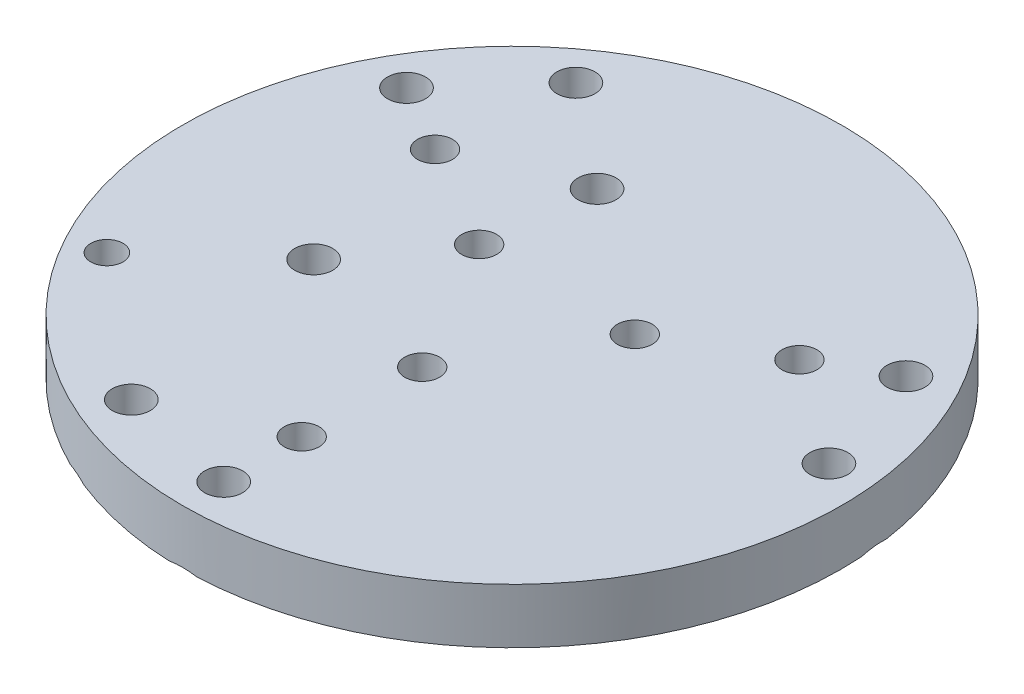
ISO-10303-21;
HEADER;
FILE_DESCRIPTION(('STEP AP214'),'2;1');
FILE_NAME('part.step','',(''),(''),'','','');
FILE_SCHEMA(('AUTOMOTIVE_DESIGN { 1 0 10303 214 1 1 1 1 }'));
ENDSEC;
DATA;
#1=APPLICATION_CONTEXT('core data for automotive mechanical design processes');
#2=APPLICATION_PROTOCOL_DEFINITION('international standard','automotive_design',2000,#1);
#3=PRODUCT_CONTEXT('',#1,'mechanical');
#4=PRODUCT('Part','Part','',(#3));
#5=PRODUCT_RELATED_PRODUCT_CATEGORY('part','',(#4));
#6=PRODUCT_DEFINITION_FORMATION('','',#4);
#7=PRODUCT_DEFINITION_CONTEXT('part definition',#1,'design');
#8=PRODUCT_DEFINITION('design','',#6,#7);
#9=PRODUCT_DEFINITION_SHAPE('','',#8);
#10=(LENGTH_UNIT() NAMED_UNIT(*) SI_UNIT(.MILLI.,.METRE.));
#11=(NAMED_UNIT(*) PLANE_ANGLE_UNIT() SI_UNIT($,.RADIAN.));
#12=(NAMED_UNIT(*) SI_UNIT($,.STERADIAN.) SOLID_ANGLE_UNIT());
#13=UNCERTAINTY_MEASURE_WITH_UNIT(LENGTH_MEASURE(1.E-05),#10,'distance_accuracy_value','');
#14=(GEOMETRIC_REPRESENTATION_CONTEXT(3) GLOBAL_UNCERTAINTY_ASSIGNED_CONTEXT((#13)) GLOBAL_UNIT_ASSIGNED_CONTEXT((#10,
#11,#12)) REPRESENTATION_CONTEXT('',''));
#15=CARTESIAN_POINT('',(0.,0.,0.));
#16=DIRECTION('',(0.,0.,1.));
#17=DIRECTION('',(1.,0.,0.));
#18=AXIS2_PLACEMENT_3D('',#15,#16,#17);
#19=CARTESIAN_POINT('',(0.,6.35,0.));
#20=DIRECTION('',(0.,-1.,0.));
#21=DIRECTION('',(0.,0.,-1.));
#22=AXIS2_PLACEMENT_3D('',#19,#20,#21);
#23=CYLINDRICAL_SURFACE('',#22,38.1);
#24=CARTESIAN_POINT('',(0.,6.35,0.));
#25=DIRECTION('',(0.,1.,0.));
#26=DIRECTION('',(0.,0.,1.));
#27=AXIS2_PLACEMENT_3D('',#24,#25,#26);
#28=CIRCLE('',#27,38.1);
#29=CARTESIAN_POINT('',(0.,6.35,38.1));
#30=VERTEX_POINT('',#29);
#31=EDGE_CURVE('E154',#30,#30,#28,.T.);
#32=ORIENTED_EDGE('',*,*,#31,.F.);
#33=EDGE_LOOP('',(#32));
#34=FACE_BOUND('',#33,.T.);
#35=CARTESIAN_POINT('',(0.,0.,0.));
#36=DIRECTION('',(0.,1.,0.));
#37=DIRECTION('',(0.,0.,1.));
#38=AXIS2_PLACEMENT_3D('',#35,#36,#37);
#39=CIRCLE('',#38,38.1);
#40=CARTESIAN_POINT('',(37.6921700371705,0.,-5.55970483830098));
#41=VERTEX_POINT('',#40);
#42=CARTESIAN_POINT('',(33.7645998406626,0.,-17.651113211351));
#43=VERTEX_POINT('',#42);
#44=EDGE_CURVE('E155',#41,#43,#39,.T.);
#45=ORIENTED_EDGE('',*,*,#44,.T.);
#46=CARTESIAN_POINT('',(33.7645998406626,0.,-17.651113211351));
#47=CARTESIAN_POINT('',(33.7144399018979,0.0224533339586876,-17.7470651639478));
#48=CARTESIAN_POINT('',(33.6636717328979,0.0429014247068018,-17.843181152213));
#49=CARTESIAN_POINT('',(33.5609579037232,0.0794930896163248,-18.0356311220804));
#50=CARTESIAN_POINT('',(33.509011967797,0.0956356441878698,-18.1319651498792));
#51=CARTESIAN_POINT('',(33.403984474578,0.123316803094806,-18.3247339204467));
#52=CARTESIAN_POINT('',(33.3509024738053,0.134853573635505,-18.4211686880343));
#53=CARTESIAN_POINT('',(33.2437151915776,0.153097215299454,-18.6139079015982));
#54=CARTESIAN_POINT('',(33.1896100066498,0.159804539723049,-18.7102123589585));
#55=CARTESIAN_POINT('',(33.0278454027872,0.172293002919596,-18.9952235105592));
#56=CARTESIAN_POINT('',(32.9188318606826,0.170950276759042,-19.1835245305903));
#57=CARTESIAN_POINT('',(32.6981750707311,0.149092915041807,-19.5572601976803));
#58=CARTESIAN_POINT('',(32.5865337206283,0.12859172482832,-19.7426967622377));
#59=CARTESIAN_POINT('',(32.4487778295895,0.0927556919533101,-19.9672019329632));
#60=CARTESIAN_POINT('',(32.4234993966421,0.0857501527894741,-20.0082234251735));
#61=CARTESIAN_POINT('',(32.3728594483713,0.0708854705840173,-20.0900543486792));
#62=CARTESIAN_POINT('',(32.3474979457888,0.0630264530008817,-20.1308638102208));
#63=CARTESIAN_POINT('',(32.2965922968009,0.046445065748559,-20.2124329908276));
#64=CARTESIAN_POINT('',(32.2710478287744,0.0377192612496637,-20.2531918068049));
#65=CARTESIAN_POINT('',(32.2198839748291,0.0194589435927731,-20.3344875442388));
#66=CARTESIAN_POINT('',(32.1942645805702,0.00992433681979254,-20.3750244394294));
#67=CARTESIAN_POINT('',(32.1686123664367,0.,-20.4154446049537));
#68=B_SPLINE_CURVE_WITH_KNOTS('',3,(#46,#47,#48,#49,#50,#51,#52,#53,#54,#55,#56,#57,#58,#59,#60,
#61,#62,#63,#64,#65,#66,#67),.UNSPECIFIED.,.F.,.F.,(4,2,2,2,2,2,2,2,2,2,4),(0.,0.33172272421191,
0.663523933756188,0.995457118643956,1.32735914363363,1.97916519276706,2.63051414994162,
2.7765858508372,2.92263610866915,3.0692901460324,3.21596118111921),.UNSPECIFIED.);
#69=CARTESIAN_POINT('',(32.1686123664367,0.,-20.4154446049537));
#70=VERTEX_POINT('',#69);
#71=EDGE_CURVE('E211',#43,#70,#68,.T.);
#72=ORIENTED_EDGE('',*,*,#71,.T.);
#73=CARTESIAN_POINT('',(-21.0782412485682,0.,-31.7382694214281));
#74=VERTEX_POINT('',#73);
#75=EDGE_CURVE('E372',#70,#74,#39,.T.);
#76=ORIENTED_EDGE('',*,*,#75,.T.);
#77=CARTESIAN_POINT('',(-21.0782412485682,0.,-31.7382694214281));
#78=CARTESIAN_POINT('',(-21.1684348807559,0.0224533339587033,-31.6783702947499));
#79=CARTESIAN_POINT('',(-21.2587281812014,0.0429014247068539,-31.6178491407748));
#80=CARTESIAN_POINT('',(-21.4394087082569,0.0794930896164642,-31.4956130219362));
#81=CARTESIAN_POINT('',(-21.5297959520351,0.0956356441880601,-31.433897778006));
#82=CARTESIAN_POINT('',(-21.7105520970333,0.123316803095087,-31.3093273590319));
#83=CARTESIAN_POINT('',(-21.8009209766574,0.134853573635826,-31.2464717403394));
#84=CARTESIAN_POINT('',(-21.9814223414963,0.153097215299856,-31.1197564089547));
#85=CARTESIAN_POINT('',(-22.071554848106,0.159804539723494,-31.0558967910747));
#86=CARTESIAN_POINT('',(-22.3381289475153,0.172293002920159,-30.8652730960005));
#87=CARTESIAN_POINT('',(-22.5140257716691,0.170950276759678,-30.7372046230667));
#88=CARTESIAN_POINT('',(-22.8626942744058,0.149092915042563,-30.4787514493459));
#89=CARTESIAN_POINT('',(-23.0354680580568,0.128591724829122,-30.3483684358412));
#90=CARTESIAN_POINT('',(-23.2443719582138,0.0927556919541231,-30.1879364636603));
#91=CARTESIAN_POINT('',(-23.282531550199,0.085750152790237,-30.1585152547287));
#92=CARTESIAN_POINT('',(-23.3586311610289,0.0708854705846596,-30.0996123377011));
#93=CARTESIAN_POINT('',(-23.3965712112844,0.0630264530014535,-30.0701306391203));
#94=CARTESIAN_POINT('',(-23.4723827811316,0.0464450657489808,-30.0109907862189));
#95=CARTESIAN_POINT('',(-23.5102533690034,0.0377192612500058,-29.9813324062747));
#96=CARTESIAN_POINT('',(-23.5857660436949,0.0194589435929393,-29.9219642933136));
#97=CARTESIAN_POINT('',(-23.6234081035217,0.00992433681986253,-29.8922545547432));
#98=CARTESIAN_POINT('',(-23.6609306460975,0.,-29.8625243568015));
#99=B_SPLINE_CURVE_WITH_KNOTS('',3,(#77,#78,#79,#80,#81,#82,#83,#84,#85,#86,#87,#88,#89,#90,#91,
#92,#93,#94,#95,#96,#97,#98),.UNSPECIFIED.,.F.,.F.,(4,2,2,2,2,2,2,2,2,2,4),(0.,
0.331722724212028,0.663523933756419,0.995457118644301,1.32735914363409,1.97916519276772,
2.63051414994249,2.77658585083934,2.92263610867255,3.06929014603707,3.21596118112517),.UNSPECIFIED.);
#100=CARTESIAN_POINT('',(-23.6609306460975,0.,-29.8625243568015));
#101=VERTEX_POINT('',#100);
#102=EDGE_CURVE('E169',#74,#101,#99,.T.);
#103=ORIENTED_EDGE('',*,*,#102,.T.);
#104=CARTESIAN_POINT('',(-32.1686123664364,0.,-20.4154446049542));
#105=VERTEX_POINT('',#104);
#106=EDGE_CURVE('E367',#101,#105,#39,.T.);
#107=ORIENTED_EDGE('',*,*,#106,.T.);
#108=CARTESIAN_POINT('',(-32.1686123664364,0.,-20.4154446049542));
#109=CARTESIAN_POINT('',(-32.2266292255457,0.0224533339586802,-20.3240288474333));
#110=CARTESIAN_POINT('',(-32.2844840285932,0.0429014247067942,-20.2320043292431));
#111=CARTESIAN_POINT('',(-32.3997936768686,0.0794930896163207,-20.0468265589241));
#112=CARTESIAN_POINT('',(-32.4572484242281,0.0956356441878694,-19.9536730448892));
#113=CARTESIAN_POINT('',(-32.5716773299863,0.123316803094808,-19.766332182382));
#114=CARTESIAN_POINT('',(-32.6286512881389,0.134853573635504,-19.6721444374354));
#115=CARTESIAN_POINT('',(-32.7419747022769,0.15309721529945,-19.4829479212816));
#116=CARTESIAN_POINT('',(-32.7983242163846,0.159804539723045,-19.3879392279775));
#117=CARTESIAN_POINT('',(-32.9642688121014,0.172293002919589,-19.105341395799));
#118=CARTESIAN_POINT('',(-33.0728355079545,0.170950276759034,-18.9167823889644));
#119=CARTESIAN_POINT('',(-33.2861716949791,0.149092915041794,-18.5388201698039));
#120=CARTESIAN_POINT('',(-33.3909437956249,0.128591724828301,-18.3494176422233));
#121=CARTESIAN_POINT('',(-33.5164930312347,0.0927556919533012,-18.1178649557));
#122=CARTESIAN_POINT('',(-33.5393794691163,0.0857501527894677,-18.0754624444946));
#123=CARTESIAN_POINT('',(-33.5849271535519,0.0708854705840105,-17.9906915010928));
#124=CARTESIAN_POINT('',(-33.6075884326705,0.0630264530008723,-17.9483230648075));
#125=CARTESIAN_POINT('',(-33.6527765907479,0.046445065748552,-17.8634528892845));
#126=CARTESIAN_POINT('',(-33.6753025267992,0.0377192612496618,-17.8209513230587));
#127=CARTESIAN_POINT('',(-33.7201247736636,0.0194589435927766,-17.7359942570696));
#128=CARTESIAN_POINT('',(-33.7424210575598,0.00992433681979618,-17.6935387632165));
#129=CARTESIAN_POINT('',(-33.7645998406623,0.,-17.6511132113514));
#130=B_SPLINE_CURVE_WITH_KNOTS('',3,(#108,#109,#110,#111,#112,#113,#114,#115,#116,#117,#118,
#119,#120,#121,#122,#123,#124,#125,#126,#127,#128,#129),.UNSPECIFIED.,.F.,.F.,(4,2,2,2,2,2,2,2,
2,2,4),(0.,0.331722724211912,0.663523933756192,0.995457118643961,1.32735914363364,
1.97916519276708,2.63051414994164,2.77658585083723,2.92263610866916,3.06929014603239,
3.21596118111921),.UNSPECIFIED.);
#131=CARTESIAN_POINT('',(-33.7645998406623,0.,-17.6511132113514));
#132=VERTEX_POINT('',#131);
#133=EDGE_CURVE('E175',#105,#132,#130,.T.);
#134=ORIENTED_EDGE('',*,*,#133,.T.);
#135=CARTESIAN_POINT('',(-16.9470269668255,0.,34.1234270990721));
#136=VERTEX_POINT('',#135);
#137=EDGE_CURVE('E369',#132,#136,#39,.T.);
#138=ORIENTED_EDGE('',*,*,#137,.T.);
#139=CARTESIAN_POINT('',(-16.9470269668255,0.,34.1234270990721));
#140=CARTESIAN_POINT('',(-16.8500559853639,0.022453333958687,34.1715875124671));
#141=CARTESIAN_POINT('',(-16.7524964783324,0.0429014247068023,34.2195232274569));
#142=CARTESIAN_POINT('',(-16.5562966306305,0.0794930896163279,34.3148790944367));
#143=CARTESIAN_POINT('',(-16.4576560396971,0.0956356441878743,34.3622991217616));
#144=CARTESIAN_POINT('',(-16.2593968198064,0.12331680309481,34.4565533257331));
#145=CARTESIAN_POINT('',(-16.1597778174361,0.134853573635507,34.5033872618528));
#146=CARTESIAN_POINT('',(-15.9597884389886,0.153097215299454,34.5963483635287));
#147=CARTESIAN_POINT('',(-15.8594181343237,0.159804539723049,34.6424755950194));
#148=CARTESIAN_POINT('',(-15.5610461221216,0.172293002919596,34.7780236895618));
#149=CARTESIAN_POINT('',(-15.3621871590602,0.170950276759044,34.8663205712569));
#150=CARTESIAN_POINT('',(-14.9640258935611,0.149092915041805,35.039049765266));
#151=CARTESIAN_POINT('',(-14.7647239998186,0.12859172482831,35.1234847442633));
#152=CARTESIAN_POINT('',(-14.5213338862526,0.0927556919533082,35.2241848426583));
#153=CARTESIAN_POINT('',(-14.4767745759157,0.0857501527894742,35.2425214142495));
#154=CARTESIAN_POINT('',(-14.3877133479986,0.0708854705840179,35.2789741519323));
#155=CARTESIAN_POINT('',(-14.3432114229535,0.0630264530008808,35.2970903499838));
#156=CARTESIAN_POINT('',(-14.254089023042,0.0464450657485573,35.3331751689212));
#157=CARTESIAN_POINT('',(-14.2094688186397,0.0377192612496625,35.3511428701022));
#158=CARTESIAN_POINT('',(-14.1202981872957,0.0194589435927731,35.3868547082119));
#159=CARTESIAN_POINT('',(-14.0757477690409,0.00992433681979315,35.4045988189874));
#160=CARTESIAN_POINT('',(-14.0312393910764,0.,35.4222291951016));
#161=B_SPLINE_CURVE_WITH_KNOTS('',3,(#139,#140,#141,#142,#143,#144,#145,#146,#147,#148,#149,
#150,#151,#152,#153,#154,#155,#156,#157,#158,#159,#160),.UNSPECIFIED.,.F.,.F.,(4,2,2,2,2,2,2,2,
2,2,4),(0.,0.33172272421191,0.663523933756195,0.995457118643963,1.32735914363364,
1.97916519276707,2.63051414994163,2.77658585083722,2.92263610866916,3.0692901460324,
3.21596118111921),.UNSPECIFIED.);
#162=CARTESIAN_POINT('',(-14.0312393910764,0.,35.4222291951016));
#163=VERTEX_POINT('',#162);
#164=EDGE_CURVE('E110',#136,#163,#161,.T.);
#165=ORIENTED_EDGE('',*,*,#164,.T.);
#166=CARTESIAN_POINT('',(-1.59598747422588,0.,38.0665578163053));
#167=VERTEX_POINT('',#166);
#168=EDGE_CURVE('E143',#163,#167,#39,.T.);
#169=ORIENTED_EDGE('',*,*,#168,.T.);
#170=CARTESIAN_POINT('',(-1.59598747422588,0.,38.0665578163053));
#171=CARTESIAN_POINT('',(-1.48781067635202,0.0224533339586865,38.0710940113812));
#172=CARTESIAN_POINT('',(-1.37918770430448,0.0429014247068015,38.0751854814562));
#173=CARTESIAN_POINT('',(-1.16116422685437,0.0794930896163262,38.0824576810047));
#174=CARTESIAN_POINT('',(-1.05176354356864,0.0956356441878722,38.0856381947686));
#175=CARTESIAN_POINT('',(-0.832307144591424,0.123316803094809,38.0910661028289));
#176=CARTESIAN_POINT('',(-0.72225118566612,0.134853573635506,38.0933131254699));
#177=CARTESIAN_POINT('',(-0.501740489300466,0.153097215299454,38.09685582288));
#178=CARTESIAN_POINT('',(-0.391285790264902,0.159804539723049,38.0981515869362));
#179=CARTESIAN_POINT('',(-0.0635765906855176,0.172293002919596,38.1005649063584));
#180=CARTESIAN_POINT('',(0.15400364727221,0.170950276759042,38.1003069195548));
#181=CARTESIAN_POINT('',(0.587996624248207,0.149092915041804,38.0960803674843));
#182=CARTESIAN_POINT('',(0.804410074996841,0.128591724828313,38.0921144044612));
#183=CARTESIAN_POINT('',(1.06771520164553,0.0927556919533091,38.0850668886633));
#184=CARTESIAN_POINT('',(1.11588007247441,0.0857501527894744,38.0836858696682));
#185=CARTESIAN_POINT('',(1.21206770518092,0.0708854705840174,38.0807458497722));
#186=CARTESIAN_POINT('',(1.26009048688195,0.0630264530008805,38.0791868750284));
#187=CARTESIAN_POINT('',(1.35618429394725,0.0464450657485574,38.0758858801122));
#188=CARTESIAN_POINT('',(1.40425469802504,0.037719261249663,38.0741431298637));
#189=CARTESIAN_POINT('',(1.50024079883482,0.0194589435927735,38.0704818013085));
#190=CARTESIAN_POINT('',(1.54815647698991,0.00992433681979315,38.0685632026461));
#191=CARTESIAN_POINT('',(1.59598747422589,0.,38.0665578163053));
#192=B_SPLINE_CURVE_WITH_KNOTS('',3,(#170,#171,#172,#173,#174,#175,#176,#177,#178,#179,#180,
#181,#182,#183,#184,#185,#186,#187,#188,#189,#190,#191),.UNSPECIFIED.,.F.,.F.,(4,2,2,2,2,2,2,2,
2,2,4),(0.,0.331722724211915,0.663523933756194,0.995457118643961,1.32735914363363,
1.97916519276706,2.63051414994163,2.77658585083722,2.92263610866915,3.0692901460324,
3.21596118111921),.UNSPECIFIED.);
#193=CARTESIAN_POINT('',(1.59598747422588,0.,38.0665578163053));
#194=VERTEX_POINT('',#193);
#195=EDGE_CURVE('E102',#167,#194,#192,.T.);
#196=ORIENTED_EDGE('',*,*,#195,.T.);
#197=CARTESIAN_POINT('',(38.0252682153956,0.,-2.38515767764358));
#198=VERTEX_POINT('',#197);
#199=EDGE_CURVE('E142',#194,#198,#39,.T.);
#200=ORIENTED_EDGE('',*,*,#199,.T.);
#201=CARTESIAN_POINT('',(38.0252682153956,0.,-2.38515767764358));
#202=CARTESIAN_POINT('',(38.0184908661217,0.0224533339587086,-2.49321721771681));
#203=CARTESIAN_POINT('',(38.0112246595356,0.0429014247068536,-2.60167408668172));
#204=CARTESIAN_POINT('',(37.9957053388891,0.0794930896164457,-2.81926607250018));
#205=CARTESIAN_POINT('',(37.9874519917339,0.0956356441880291,-2.92840134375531));
#206=CARTESIAN_POINT('',(37.9699489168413,0.123316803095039,-3.14722596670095));
#207=CARTESIAN_POINT('',(37.9606987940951,0.134853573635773,-3.25691552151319));
#208=CARTESIAN_POINT('',(37.9412107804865,0.153097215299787,-3.4765919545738));
#209=CARTESIAN_POINT('',(37.9309729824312,0.159804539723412,-3.58657880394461));
#210=CARTESIAN_POINT('',(37.8991750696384,0.172293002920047,-3.91275059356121));
#211=CARTESIAN_POINT('',(37.8762129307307,0.170950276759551,-4.12911594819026));
#212=CARTESIAN_POINT('',(37.8267201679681,0.149092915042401,-4.56029831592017));
#213=CARTESIAN_POINT('',(37.8001920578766,0.12859172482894,-4.77511630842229));
#214=CARTESIAN_POINT('',(37.7657058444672,0.0927556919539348,-5.03624837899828));
#215=CARTESIAN_POINT('',(37.759306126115,0.0857501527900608,-5.08400615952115));
#216=CARTESIAN_POINT('',(37.7463445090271,0.0708854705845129,-5.17936181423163));
#217=CARTESIAN_POINT('',(37.7397826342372,0.0630264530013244,-5.22695971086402));
#218=CARTESIAN_POINT('',(37.726471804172,0.0464450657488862,-5.322184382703));
#219=CARTESIAN_POINT('',(37.7197221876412,0.0377192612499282,-5.36981046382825));
#220=CARTESIAN_POINT('',(37.706064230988,0.0194589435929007,-5.4648904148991));
#221=CARTESIAN_POINT('',(37.6991558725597,0.00992433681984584,-5.51234426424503));
#222=CARTESIAN_POINT('',(37.6921700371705,0.,-5.55970483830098));
#223=B_SPLINE_CURVE_WITH_KNOTS('',3,(#201,#202,#203,#204,#205,#206,#207,#208,#209,#210,#211,
#212,#213,#214,#215,#216,#217,#218,#219,#220,#221,#222),.UNSPECIFIED.,.F.,.F.,(4,2,2,2,2,2,2,2,
2,2,4),(0.,0.331722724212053,0.663523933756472,0.99545711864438,1.32735914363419,
1.97916519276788,2.6305141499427,2.77658585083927,2.92263610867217,3.0692901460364,
3.21596118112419),.UNSPECIFIED.);
#224=EDGE_CURVE('E144',#198,#41,#223,.T.);
#225=ORIENTED_EDGE('',*,*,#224,.T.);
#226=EDGE_LOOP('',(#45,#72,#76,#103,#107,#134,#138,#165,#169,#196,#200,#225));
#227=FACE_BOUND('',#226,.T.);
#228=ADVANCED_FACE('F88',(#34,#227),#23,.T.);
#229=CARTESIAN_POINT('',(0.,6.35,0.));
#230=DIRECTION('',(0.,1.,0.));
#231=DIRECTION('',(0.,0.,1.));
#232=AXIS2_PLACEMENT_3D('',#229,#230,#231);
#233=PLANE('',#232);
#234=CARTESIAN_POINT('',(33.1554813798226,6.35,-3.47893097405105));
#235=DIRECTION('',(0.,1.,0.));
#236=DIRECTION('',(0.,0.,1.));
#237=AXIS2_PLACEMENT_3D('',#234,#235,#236);
#238=CIRCLE('',#237,2.19710000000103);
#239=CARTESIAN_POINT('',(33.1554813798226,6.35,-1.28183097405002));
#240=VERTEX_POINT('',#239);
#241=EDGE_CURVE('E298',#240,#240,#238,.T.);
#242=ORIENTED_EDGE('',*,*,#241,.F.);
#243=EDGE_LOOP('',(#242));
#244=FACE_BOUND('',#243,.T.);
#245=CARTESIAN_POINT('',(-19.5905832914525,6.35,-26.9740236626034));
#246=DIRECTION('',(0.,1.,0.));
#247=DIRECTION('',(0.,0.,1.));
#248=AXIS2_PLACEMENT_3D('',#245,#246,#247);
#249=CIRCLE('',#248,2.19710000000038);
#250=CARTESIAN_POINT('',(-19.5905832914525,6.35,-24.776923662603));
#251=VERTEX_POINT('',#250);
#252=EDGE_CURVE('E302',#251,#251,#249,.T.);
#253=ORIENTED_EDGE('',*,*,#252,.F.);
#254=EDGE_LOOP('',(#253));
#255=FACE_BOUND('',#254,.T.);
#256=CARTESIAN_POINT('',(-17.0688,6.35,5.8674));
#257=DIRECTION('',(0.,1.,0.));
#258=DIRECTION('',(0.,0.,1.));
#259=AXIS2_PLACEMENT_3D('',#256,#257,#258);
#260=CIRCLE('',#259,2.1971);
#261=CARTESIAN_POINT('',(-17.0688,6.35,8.0645));
#262=VERTEX_POINT('',#261);
#263=EDGE_CURVE('E306',#262,#262,#260,.T.);
#264=ORIENTED_EDGE('',*,*,#263,.F.);
#265=EDGE_LOOP('',(#264));
#266=FACE_BOUND('',#265,.T.);
#267=CARTESIAN_POINT('',(-7.747,6.35,-17.5768));
#268=DIRECTION('',(0.,1.,0.));
#269=DIRECTION('',(0.,0.,1.));
#270=AXIS2_PLACEMENT_3D('',#267,#268,#269);
#271=CIRCLE('',#270,2.1971);
#272=CARTESIAN_POINT('',(-7.747,6.35,-15.3797));
#273=VERTEX_POINT('',#272);
#274=EDGE_CURVE('E310',#273,#273,#271,.T.);
#275=ORIENTED_EDGE('',*,*,#274,.F.);
#276=EDGE_LOOP('',(#275));
#277=FACE_BOUND('',#276,.T.);
#278=CARTESIAN_POINT('',(-13.5648980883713,6.35,30.4529546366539));
#279=DIRECTION('',(0.,1.,0.));
#280=DIRECTION('',(0.,0.,1.));
#281=AXIS2_PLACEMENT_3D('',#278,#279,#280);
#282=CIRCLE('',#281,2.1971);
#283=CARTESIAN_POINT('',(-13.5648980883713,6.35,32.6500546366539));
#284=VERTEX_POINT('',#283);
#285=EDGE_CURVE('E314',#284,#284,#282,.T.);
#286=ORIENTED_EDGE('',*,*,#285,.F.);
#287=EDGE_LOOP('',(#286));
#288=FACE_BOUND('',#287,.T.);
#289=CARTESIAN_POINT('',(28.8711218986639,6.35,-16.6687499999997));
#290=DIRECTION('',(0.,1.,0.));
#291=DIRECTION('',(0.,0.,1.));
#292=AXIS2_PLACEMENT_3D('',#289,#290,#291);
#293=CIRCLE('',#292,2.19709999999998);
#294=CARTESIAN_POINT('',(28.8711218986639,6.35,-14.4716499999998));
#295=VERTEX_POINT('',#294);
#296=EDGE_CURVE('E318',#295,#295,#293,.T.);
#297=ORIENTED_EDGE('',*,*,#296,.F.);
#298=EDGE_LOOP('',(#297));
#299=FACE_BOUND('',#298,.T.);
#300=CARTESIAN_POINT('',(-28.8711218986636,6.35,-16.6687500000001));
#301=DIRECTION('',(0.,1.,0.));
#302=DIRECTION('',(0.,0.,1.));
#303=AXIS2_PLACEMENT_3D('',#300,#301,#302);
#304=CIRCLE('',#303,2.19709999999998);
#305=CARTESIAN_POINT('',(-28.8711218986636,6.35,-14.4716500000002));
#306=VERTEX_POINT('',#305);
#307=EDGE_CURVE('E322',#306,#306,#304,.T.);
#308=ORIENTED_EDGE('',*,*,#307,.F.);
#309=EDGE_LOOP('',(#308));
#310=FACE_BOUND('',#309,.T.);
#311=CARTESIAN_POINT('',(0.,6.35,33.3375));
#312=DIRECTION('',(0.,1.,0.));
#313=DIRECTION('',(0.,0.,1.));
#314=AXIS2_PLACEMENT_3D('',#311,#312,#313);
#315=CIRCLE('',#314,2.19709999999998);
#316=CARTESIAN_POINT('',(0.,6.35,35.5346));
#317=VERTEX_POINT('',#316);
#318=EDGE_CURVE('E326',#317,#317,#315,.T.);
#319=ORIENTED_EDGE('',*,*,#318,.F.);
#320=EDGE_LOOP('',(#319));
#321=FACE_BOUND('',#320,.T.);
#322=CARTESIAN_POINT('',(-29.6960110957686,6.35,17.1449999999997));
#323=DIRECTION('',(0.,1.,0.));
#324=DIRECTION('',(0.,0.,1.));
#325=AXIS2_PLACEMENT_3D('',#322,#323,#324);
#326=CIRCLE('',#325,1.8669);
#327=CARTESIAN_POINT('',(-29.6960110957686,6.35,19.0118999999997));
#328=VERTEX_POINT('',#327);
#329=EDGE_CURVE('E330',#328,#328,#326,.T.);
#330=ORIENTED_EDGE('',*,*,#329,.F.);
#331=EDGE_LOOP('',(#330));
#332=FACE_BOUND('',#331,.T.);
#333=CARTESIAN_POINT('',(21.0621708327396,6.35,-12.1602499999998));
#334=DIRECTION('',(0.,1.,0.));
#335=DIRECTION('',(0.866025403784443,0.,-0.499999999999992));
#336=AXIS2_PLACEMENT_3D('',#333,#334,#335);
#337=CIRCLE('',#336,2.0193);
#338=CARTESIAN_POINT('',(22.8109359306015,6.35,-13.1698999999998));
#339=VERTEX_POINT('',#338);
#340=EDGE_CURVE('E334',#339,#339,#337,.T.);
#341=ORIENTED_EDGE('',*,*,#340,.F.);
#342=EDGE_LOOP('',(#341));
#343=FACE_BOUND('',#342,.T.);
#344=CARTESIAN_POINT('',(8.99679150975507,6.35,-5.19429999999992));
#345=DIRECTION('',(0.,1.,0.));
#346=DIRECTION('',(0.866025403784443,0.,-0.499999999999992));
#347=AXIS2_PLACEMENT_3D('',#344,#345,#346);
#348=CIRCLE('',#347,2.0193);
#349=CARTESIAN_POINT('',(10.745556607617,6.35,-6.2039499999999));
#350=VERTEX_POINT('',#349);
#351=EDGE_CURVE('E338',#350,#350,#348,.T.);
#352=ORIENTED_EDGE('',*,*,#351,.F.);
#353=EDGE_LOOP('',(#352));
#354=FACE_BOUND('',#353,.T.);
#355=CARTESIAN_POINT('',(-21.0621708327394,6.35,-12.1602500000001));
#356=DIRECTION('',(0.,1.,0.));
#357=DIRECTION('',(-0.866025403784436,0.,-0.500000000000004));
#358=AXIS2_PLACEMENT_3D('',#355,#356,#357);
#359=CIRCLE('',#358,2.0193);
#360=CARTESIAN_POINT('',(-22.8109359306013,6.35,-13.1699000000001));
#361=VERTEX_POINT('',#360);
#362=EDGE_CURVE('E342',#361,#361,#359,.T.);
#363=ORIENTED_EDGE('',*,*,#362,.F.);
#364=EDGE_LOOP('',(#363));
#365=FACE_BOUND('',#364,.T.);
#366=CARTESIAN_POINT('',(-8.99679150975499,6.35,-5.19430000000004));
#367=DIRECTION('',(0.,1.,0.));
#368=DIRECTION('',(-0.866025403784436,0.,-0.500000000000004));
#369=AXIS2_PLACEMENT_3D('',#366,#367,#368);
#370=CIRCLE('',#369,2.0193);
#371=CARTESIAN_POINT('',(-10.7455566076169,6.35,-6.20395000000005));
#372=VERTEX_POINT('',#371);
#373=EDGE_CURVE('E346',#372,#372,#370,.T.);
#374=ORIENTED_EDGE('',*,*,#373,.F.);
#375=EDGE_LOOP('',(#374));
#376=FACE_BOUND('',#375,.T.);
#377=CARTESIAN_POINT('',(0.,6.35,24.3205));
#378=DIRECTION('',(0.,1.,0.));
#379=DIRECTION('',(0.,0.,1.));
#380=AXIS2_PLACEMENT_3D('',#377,#378,#379);
#381=CIRCLE('',#380,2.0193);
#382=CARTESIAN_POINT('',(0.,6.35,26.3398));
#383=VERTEX_POINT('',#382);
#384=EDGE_CURVE('E350',#383,#383,#381,.T.);
#385=ORIENTED_EDGE('',*,*,#384,.F.);
#386=EDGE_LOOP('',(#385));
#387=FACE_BOUND('',#386,.T.);
#388=CARTESIAN_POINT('',(0.,6.35,10.3886));
#389=DIRECTION('',(0.,1.,0.));
#390=DIRECTION('',(0.,0.,1.));
#391=AXIS2_PLACEMENT_3D('',#388,#389,#390);
#392=CIRCLE('',#391,2.0193);
#393=CARTESIAN_POINT('',(0.,6.35,12.4079));
#394=VERTEX_POINT('',#393);
#395=EDGE_CURVE('E354',#394,#394,#392,.T.);
#396=ORIENTED_EDGE('',*,*,#395,.F.);
#397=EDGE_LOOP('',(#396));
#398=FACE_BOUND('',#397,.T.);
#399=ORIENTED_EDGE('',*,*,#31,.T.);
#400=EDGE_LOOP('',(#399));
#401=FACE_BOUND('',#400,.T.);
#402=ADVANCED_FACE('F287',(#244,#255,#266,#277,#288,#299,#310,#321,#332,#343,#354,#365,#376,
#387,#398,#401),#233,.T.);
#403=CARTESIAN_POINT('',(0.,0.,0.));
#404=DIRECTION('',(0.,1.,0.));
#405=DIRECTION('',(0.,0.,1.));
#406=AXIS2_PLACEMENT_3D('',#403,#404,#405);
#407=PLANE('',#406);
#408=CARTESIAN_POINT('',(-17.0688,0.,5.8674));
#409=DIRECTION('',(0.,1.,0.));
#410=DIRECTION('',(0.,0.,1.));
#411=AXIS2_PLACEMENT_3D('',#408,#409,#410);
#412=CIRCLE('',#411,4.99110847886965);
#413=CARTESIAN_POINT('',(-17.0688,0.,10.8585084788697));
#414=VERTEX_POINT('',#413);
#415=EDGE_CURVE('E462',#414,#414,#412,.T.);
#416=ORIENTED_EDGE('',*,*,#415,.T.);
#417=EDGE_LOOP('',(#416));
#418=FACE_BOUND('',#417,.T.);
#419=CARTESIAN_POINT('',(-7.747,0.,-17.5768));
#420=DIRECTION('',(0.,1.,0.));
#421=DIRECTION('',(0.,0.,1.));
#422=AXIS2_PLACEMENT_3D('',#419,#420,#421);
#423=CIRCLE('',#422,4.99110847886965);
#424=CARTESIAN_POINT('',(-7.747,0.,-12.5856915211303));
#425=VERTEX_POINT('',#424);
#426=EDGE_CURVE('E459',#425,#425,#423,.T.);
#427=ORIENTED_EDGE('',*,*,#426,.T.);
#428=EDGE_LOOP('',(#427));
#429=FACE_BOUND('',#428,.T.);
#430=CARTESIAN_POINT('',(-29.6960110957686,0.,17.1449999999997));
#431=DIRECTION('',(0.,1.,0.));
#432=DIRECTION('',(0.,0.,1.));
#433=AXIS2_PLACEMENT_3D('',#430,#431,#432);
#434=CIRCLE('',#433,1.8669);
#435=CARTESIAN_POINT('',(-29.6960110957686,0.,19.0118999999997));
#436=VERTEX_POINT('',#435);
#437=EDGE_CURVE('E399',#436,#436,#434,.T.);
#438=ORIENTED_EDGE('',*,*,#437,.T.);
#439=EDGE_LOOP('',(#438));
#440=FACE_BOUND('',#439,.T.);
#441=CARTESIAN_POINT('',(21.0621708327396,0.,-12.1602499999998));
#442=DIRECTION('',(0.,1.,0.));
#443=DIRECTION('',(0.866025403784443,0.,-0.499999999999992));
#444=AXIS2_PLACEMENT_3D('',#441,#442,#443);
#445=CIRCLE('',#444,2.0193);
#446=CARTESIAN_POINT('',(22.8109359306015,0.,-13.1698999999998));
#447=VERTEX_POINT('',#446);
#448=EDGE_CURVE('E395',#447,#447,#445,.T.);
#449=ORIENTED_EDGE('',*,*,#448,.T.);
#450=EDGE_LOOP('',(#449));
#451=FACE_BOUND('',#450,.T.);
#452=CARTESIAN_POINT('',(8.99679150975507,0.,-5.19429999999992));
#453=DIRECTION('',(0.,1.,0.));
#454=DIRECTION('',(0.866025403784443,0.,-0.499999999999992));
#455=AXIS2_PLACEMENT_3D('',#452,#453,#454);
#456=CIRCLE('',#455,2.0193);
#457=CARTESIAN_POINT('',(10.745556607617,0.,-6.2039499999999));
#458=VERTEX_POINT('',#457);
#459=EDGE_CURVE('E391',#458,#458,#456,.T.);
#460=ORIENTED_EDGE('',*,*,#459,.T.);
#461=EDGE_LOOP('',(#460));
#462=FACE_BOUND('',#461,.T.);
#463=CARTESIAN_POINT('',(-21.0621708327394,0.,-12.1602500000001));
#464=DIRECTION('',(0.,1.,0.));
#465=DIRECTION('',(-0.866025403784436,0.,-0.500000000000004));
#466=AXIS2_PLACEMENT_3D('',#463,#464,#465);
#467=CIRCLE('',#466,2.0193);
#468=CARTESIAN_POINT('',(-22.8109359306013,0.,-13.1699000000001));
#469=VERTEX_POINT('',#468);
#470=EDGE_CURVE('E387',#469,#469,#467,.T.);
#471=ORIENTED_EDGE('',*,*,#470,.T.);
#472=EDGE_LOOP('',(#471));
#473=FACE_BOUND('',#472,.T.);
#474=CARTESIAN_POINT('',(-8.99679150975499,0.,-5.19430000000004));
#475=DIRECTION('',(0.,1.,0.));
#476=DIRECTION('',(-0.866025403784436,0.,-0.500000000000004));
#477=AXIS2_PLACEMENT_3D('',#474,#475,#476);
#478=CIRCLE('',#477,2.0193);
#479=CARTESIAN_POINT('',(-10.7455566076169,0.,-6.20395000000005));
#480=VERTEX_POINT('',#479);
#481=EDGE_CURVE('E383',#480,#480,#478,.T.);
#482=ORIENTED_EDGE('',*,*,#481,.T.);
#483=EDGE_LOOP('',(#482));
#484=FACE_BOUND('',#483,.T.);
#485=CARTESIAN_POINT('',(0.,0.,24.3205));
#486=DIRECTION('',(0.,1.,0.));
#487=DIRECTION('',(0.,0.,1.));
#488=AXIS2_PLACEMENT_3D('',#485,#486,#487);
#489=CIRCLE('',#488,2.0193);
#490=CARTESIAN_POINT('',(0.,0.,26.3398));
#491=VERTEX_POINT('',#490);
#492=EDGE_CURVE('E377',#491,#491,#489,.T.);
#493=ORIENTED_EDGE('',*,*,#492,.T.);
#494=EDGE_LOOP('',(#493));
#495=FACE_BOUND('',#494,.T.);
#496=CARTESIAN_POINT('',(0.,0.,10.3886));
#497=DIRECTION('',(0.,1.,0.));
#498=DIRECTION('',(0.,0.,1.));
#499=AXIS2_PLACEMENT_3D('',#496,#497,#498);
#500=CIRCLE('',#499,2.0193);
#501=CARTESIAN_POINT('',(0.,0.,12.4079));
#502=VERTEX_POINT('',#501);
#503=EDGE_CURVE('E373',#502,#502,#500,.T.);
#504=ORIENTED_EDGE('',*,*,#503,.T.);
#505=EDGE_LOOP('',(#504));
#506=FACE_BOUND('',#505,.T.);
#507=ORIENTED_EDGE('',*,*,#75,.F.);
#508=CARTESIAN_POINT('',(28.8711218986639,0.,-16.6687499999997));
#509=DIRECTION('',(0.,1.,0.));
#510=DIRECTION('',(0.,0.,1.));
#511=AXIS2_PLACEMENT_3D('',#508,#509,#510);
#512=CIRCLE('',#511,4.99110847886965);
#513=EDGE_CURVE('E160',#70,#43,#512,.T.);
#514=ORIENTED_EDGE('',*,*,#513,.T.);
#515=ORIENTED_EDGE('',*,*,#44,.F.);
#516=CARTESIAN_POINT('',(33.1554813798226,0.,-3.47893097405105));
#517=DIRECTION('',(0.,1.,0.));
#518=DIRECTION('',(0.,0.,1.));
#519=AXIS2_PLACEMENT_3D('',#516,#517,#518);
#520=CIRCLE('',#519,4.99110847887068);
#521=EDGE_CURVE('E153',#41,#198,#520,.T.);
#522=ORIENTED_EDGE('',*,*,#521,.T.);
#523=ORIENTED_EDGE('',*,*,#199,.F.);
#524=CARTESIAN_POINT('',(0.,0.,33.3375));
#525=DIRECTION('',(0.,1.,0.));
#526=DIRECTION('',(0.,0.,1.));
#527=AXIS2_PLACEMENT_3D('',#524,#525,#526);
#528=CIRCLE('',#527,4.99110847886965);
#529=EDGE_CURVE('E150',#194,#167,#528,.T.);
#530=ORIENTED_EDGE('',*,*,#529,.T.);
#531=ORIENTED_EDGE('',*,*,#168,.F.);
#532=CARTESIAN_POINT('',(-13.5648980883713,0.,30.4529546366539));
#533=DIRECTION('',(0.,1.,0.));
#534=DIRECTION('',(0.,0.,1.));
#535=AXIS2_PLACEMENT_3D('',#532,#533,#534);
#536=CIRCLE('',#535,4.99110847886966);
#537=EDGE_CURVE('E158',#163,#136,#536,.T.);
#538=ORIENTED_EDGE('',*,*,#537,.T.);
#539=ORIENTED_EDGE('',*,*,#137,.F.);
#540=CARTESIAN_POINT('',(-28.8711218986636,0.,-16.6687500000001));
#541=DIRECTION('',(0.,1.,0.));
#542=DIRECTION('',(0.,0.,1.));
#543=AXIS2_PLACEMENT_3D('',#540,#541,#542);
#544=CIRCLE('',#543,4.99110847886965);
#545=EDGE_CURVE('E163',#132,#105,#544,.T.);
#546=ORIENTED_EDGE('',*,*,#545,.T.);
#547=ORIENTED_EDGE('',*,*,#106,.F.);
#548=CARTESIAN_POINT('',(-19.5905832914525,0.,-26.9740236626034));
#549=DIRECTION('',(0.,1.,0.));
#550=DIRECTION('',(0.,0.,1.));
#551=AXIS2_PLACEMENT_3D('',#548,#549,#550);
#552=CIRCLE('',#551,4.99110847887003);
#553=EDGE_CURVE('E357',#101,#74,#552,.T.);
#554=ORIENTED_EDGE('',*,*,#553,.T.);
#555=EDGE_LOOP('',(#507,#514,#515,#522,#523,#530,#531,#538,#539,#546,#547,#554));
#556=FACE_BOUND('',#555,.T.);
#557=ADVANCED_FACE('F149',(#418,#429,#440,#451,#462,#473,#484,#495,#506,#556),#407,.F.);
#558=CARTESIAN_POINT('',(0.,0.,10.3886));
#559=DIRECTION('',(0.,1.,0.));
#560=DIRECTION('',(0.,0.,1.));
#561=AXIS2_PLACEMENT_3D('',#558,#559,#560);
#562=CYLINDRICAL_SURFACE('',#561,2.0193);
#563=ORIENTED_EDGE('',*,*,#503,.F.);
#564=EDGE_LOOP('',(#563));
#565=FACE_BOUND('',#564,.T.);
#566=ORIENTED_EDGE('',*,*,#395,.T.);
#567=EDGE_LOOP('',(#566));
#568=FACE_BOUND('',#567,.T.);
#569=ADVANCED_FACE('F281',(#565,#568),#562,.F.);
#570=CARTESIAN_POINT('',(0.,0.,24.3205));
#571=DIRECTION('',(0.,1.,0.));
#572=DIRECTION('',(0.,0.,1.));
#573=AXIS2_PLACEMENT_3D('',#570,#571,#572);
#574=CYLINDRICAL_SURFACE('',#573,2.0193);
#575=ORIENTED_EDGE('',*,*,#492,.F.);
#576=EDGE_LOOP('',(#575));
#577=FACE_BOUND('',#576,.T.);
#578=ORIENTED_EDGE('',*,*,#384,.T.);
#579=EDGE_LOOP('',(#578));
#580=FACE_BOUND('',#579,.T.);
#581=ADVANCED_FACE('F277',(#577,#580),#574,.F.);
#582=CARTESIAN_POINT('',(-8.99679150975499,0.,-5.19430000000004));
#583=DIRECTION('',(0.,1.,0.));
#584=DIRECTION('',(0.,0.,1.));
#585=AXIS2_PLACEMENT_3D('',#582,#583,#584);
#586=CYLINDRICAL_SURFACE('',#585,2.0193);
#587=ORIENTED_EDGE('',*,*,#481,.F.);
#588=EDGE_LOOP('',(#587));
#589=FACE_BOUND('',#588,.T.);
#590=ORIENTED_EDGE('',*,*,#373,.T.);
#591=EDGE_LOOP('',(#590));
#592=FACE_BOUND('',#591,.T.);
#593=ADVANCED_FACE('F273',(#589,#592),#586,.F.);
#594=CARTESIAN_POINT('',(-21.0621708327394,0.,-12.1602500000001));
#595=DIRECTION('',(0.,1.,0.));
#596=DIRECTION('',(0.,0.,1.));
#597=AXIS2_PLACEMENT_3D('',#594,#595,#596);
#598=CYLINDRICAL_SURFACE('',#597,2.0193);
#599=ORIENTED_EDGE('',*,*,#470,.F.);
#600=EDGE_LOOP('',(#599));
#601=FACE_BOUND('',#600,.T.);
#602=ORIENTED_EDGE('',*,*,#362,.T.);
#603=EDGE_LOOP('',(#602));
#604=FACE_BOUND('',#603,.T.);
#605=ADVANCED_FACE('F269',(#601,#604),#598,.F.);
#606=CARTESIAN_POINT('',(8.99679150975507,0.,-5.19429999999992));
#607=DIRECTION('',(0.,1.,0.));
#608=DIRECTION('',(0.,0.,1.));
#609=AXIS2_PLACEMENT_3D('',#606,#607,#608);
#610=CYLINDRICAL_SURFACE('',#609,2.0193);
#611=ORIENTED_EDGE('',*,*,#459,.F.);
#612=EDGE_LOOP('',(#611));
#613=FACE_BOUND('',#612,.T.);
#614=ORIENTED_EDGE('',*,*,#351,.T.);
#615=EDGE_LOOP('',(#614));
#616=FACE_BOUND('',#615,.T.);
#617=ADVANCED_FACE('F265',(#613,#616),#610,.F.);
#618=CARTESIAN_POINT('',(21.0621708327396,0.,-12.1602499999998));
#619=DIRECTION('',(0.,1.,0.));
#620=DIRECTION('',(0.,0.,1.));
#621=AXIS2_PLACEMENT_3D('',#618,#619,#620);
#622=CYLINDRICAL_SURFACE('',#621,2.0193);
#623=ORIENTED_EDGE('',*,*,#448,.F.);
#624=EDGE_LOOP('',(#623));
#625=FACE_BOUND('',#624,.T.);
#626=ORIENTED_EDGE('',*,*,#340,.T.);
#627=EDGE_LOOP('',(#626));
#628=FACE_BOUND('',#627,.T.);
#629=ADVANCED_FACE('F261',(#625,#628),#622,.F.);
#630=CARTESIAN_POINT('',(-29.6960110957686,0.,17.1449999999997));
#631=DIRECTION('',(0.,1.,0.));
#632=DIRECTION('',(0.,0.,1.));
#633=AXIS2_PLACEMENT_3D('',#630,#631,#632);
#634=CYLINDRICAL_SURFACE('',#633,1.8669);
#635=ORIENTED_EDGE('',*,*,#437,.F.);
#636=EDGE_LOOP('',(#635));
#637=FACE_BOUND('',#636,.T.);
#638=ORIENTED_EDGE('',*,*,#329,.T.);
#639=EDGE_LOOP('',(#638));
#640=FACE_BOUND('',#639,.T.);
#641=ADVANCED_FACE('F257',(#637,#640),#634,.F.);
#642=CARTESIAN_POINT('',(0.,6.35,33.3375));
#643=DIRECTION('',(0.,1.,0.));
#644=DIRECTION('',(0.,0.,1.));
#645=AXIS2_PLACEMENT_3D('',#642,#643,#644);
#646=CYLINDRICAL_SURFACE('',#645,2.19709999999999);
#647=CARTESIAN_POINT('',(0.,2.07010000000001,33.3375));
#648=DIRECTION('',(0.,1.,0.));
#649=DIRECTION('',(0.,0.,1.));
#650=AXIS2_PLACEMENT_3D('',#647,#648,#649);
#651=CIRCLE('',#650,2.19709999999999);
#652=CARTESIAN_POINT('',(0.,2.07010000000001,35.5346));
#653=VERTEX_POINT('',#652);
#654=EDGE_CURVE('E445',#653,#653,#651,.F.);
#655=ORIENTED_EDGE('',*,*,#654,.T.);
#656=EDGE_LOOP('',(#655));
#657=FACE_BOUND('',#656,.T.);
#658=ORIENTED_EDGE('',*,*,#318,.T.);
#659=EDGE_LOOP('',(#658));
#660=FACE_BOUND('',#659,.T.);
#661=ADVANCED_FACE('F253',(#657,#660),#646,.F.);
#662=CARTESIAN_POINT('',(-28.8711218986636,6.35,-16.6687500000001));
#663=DIRECTION('',(0.,1.,0.));
#664=DIRECTION('',(0.,0.,1.));
#665=AXIS2_PLACEMENT_3D('',#662,#663,#664);
#666=CYLINDRICAL_SURFACE('',#665,2.19709999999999);
#667=CARTESIAN_POINT('',(-28.8711218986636,2.07010000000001,-16.6687500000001));
#668=DIRECTION('',(0.,1.,0.));
#669=DIRECTION('',(0.,0.,1.));
#670=AXIS2_PLACEMENT_3D('',#667,#668,#669);
#671=CIRCLE('',#670,2.19709999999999);
#672=CARTESIAN_POINT('',(-28.8711218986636,2.07010000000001,-14.4716500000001));
#673=VERTEX_POINT('',#672);
#674=EDGE_CURVE('E453',#673,#673,#671,.F.);
#675=ORIENTED_EDGE('',*,*,#674,.T.);
#676=EDGE_LOOP('',(#675));
#677=FACE_BOUND('',#676,.T.);
#678=ORIENTED_EDGE('',*,*,#307,.T.);
#679=EDGE_LOOP('',(#678));
#680=FACE_BOUND('',#679,.T.);
#681=ADVANCED_FACE('F249',(#677,#680),#666,.F.);
#682=CARTESIAN_POINT('',(28.8711218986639,6.35,-16.6687499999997));
#683=DIRECTION('',(0.,1.,0.));
#684=DIRECTION('',(0.,0.,1.));
#685=AXIS2_PLACEMENT_3D('',#682,#683,#684);
#686=CYLINDRICAL_SURFACE('',#685,2.19709999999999);
#687=CARTESIAN_POINT('',(28.8711218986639,2.07010000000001,-16.6687499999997));
#688=DIRECTION('',(0.,1.,0.));
#689=DIRECTION('',(0.,0.,1.));
#690=AXIS2_PLACEMENT_3D('',#687,#688,#689);
#691=CIRCLE('',#690,2.19709999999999);
#692=CARTESIAN_POINT('',(28.8711218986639,2.07010000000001,-14.4716499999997));
#693=VERTEX_POINT('',#692);
#694=EDGE_CURVE('E440',#693,#693,#691,.F.);
#695=ORIENTED_EDGE('',*,*,#694,.T.);
#696=EDGE_LOOP('',(#695));
#697=FACE_BOUND('',#696,.T.);
#698=ORIENTED_EDGE('',*,*,#296,.T.);
#699=EDGE_LOOP('',(#698));
#700=FACE_BOUND('',#699,.T.);
#701=ADVANCED_FACE('F245',(#697,#700),#686,.F.);
#702=CARTESIAN_POINT('',(-13.5648980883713,-19.05,30.4529546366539));
#703=DIRECTION('',(0.,1.,0.));
#704=DIRECTION('',(0.,0.,1.));
#705=AXIS2_PLACEMENT_3D('',#702,#703,#704);
#706=CYLINDRICAL_SURFACE('',#705,2.1971);
#707=CARTESIAN_POINT('',(-13.5648980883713,2.07010000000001,30.4529546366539));
#708=DIRECTION('',(0.,1.,0.));
#709=DIRECTION('',(0.,0.,1.));
#710=AXIS2_PLACEMENT_3D('',#707,#708,#709);
#711=CIRCLE('',#710,2.1971);
#712=CARTESIAN_POINT('',(-13.5648980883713,2.07010000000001,32.6500546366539));
#713=VERTEX_POINT('',#712);
#714=EDGE_CURVE('E450',#713,#713,#711,.F.);
#715=ORIENTED_EDGE('',*,*,#714,.T.);
#716=EDGE_LOOP('',(#715));
#717=FACE_BOUND('',#716,.T.);
#718=ORIENTED_EDGE('',*,*,#285,.T.);
#719=EDGE_LOOP('',(#718));
#720=FACE_BOUND('',#719,.T.);
#721=ADVANCED_FACE('F241',(#717,#720),#706,.F.);
#722=CARTESIAN_POINT('',(-7.747,-19.05,-17.5768));
#723=DIRECTION('',(0.,1.,0.));
#724=DIRECTION('',(0.,0.,1.));
#725=AXIS2_PLACEMENT_3D('',#722,#723,#724);
#726=CYLINDRICAL_SURFACE('',#725,2.1971);
#727=CARTESIAN_POINT('',(-7.747,2.07010000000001,-17.5768));
#728=DIRECTION('',(0.,1.,0.));
#729=DIRECTION('',(0.,0.,1.));
#730=AXIS2_PLACEMENT_3D('',#727,#728,#729);
#731=CIRCLE('',#730,2.1971);
#732=CARTESIAN_POINT('',(-7.747,2.07010000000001,-15.3797));
#733=VERTEX_POINT('',#732);
#734=EDGE_CURVE('E12',#733,#733,#731,.F.);
#735=ORIENTED_EDGE('',*,*,#734,.T.);
#736=EDGE_LOOP('',(#735));
#737=FACE_BOUND('',#736,.T.);
#738=ORIENTED_EDGE('',*,*,#274,.T.);
#739=EDGE_LOOP('',(#738));
#740=FACE_BOUND('',#739,.T.);
#741=ADVANCED_FACE('F237',(#737,#740),#726,.F.);
#742=CARTESIAN_POINT('',(-17.0688,-19.05,5.8674));
#743=DIRECTION('',(0.,1.,0.));
#744=DIRECTION('',(0.,0.,1.));
#745=AXIS2_PLACEMENT_3D('',#742,#743,#744);
#746=CYLINDRICAL_SURFACE('',#745,2.1971);
#747=CARTESIAN_POINT('',(-17.0688,2.07010000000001,5.8674));
#748=DIRECTION('',(0.,1.,0.));
#749=DIRECTION('',(0.,0.,1.));
#750=AXIS2_PLACEMENT_3D('',#747,#748,#749);
#751=CIRCLE('',#750,2.1971);
#752=CARTESIAN_POINT('',(-17.0688,2.07010000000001,8.0645));
#753=VERTEX_POINT('',#752);
#754=EDGE_CURVE('E96',#753,#753,#751,.F.);
#755=ORIENTED_EDGE('',*,*,#754,.T.);
#756=EDGE_LOOP('',(#755));
#757=FACE_BOUND('',#756,.T.);
#758=ORIENTED_EDGE('',*,*,#263,.T.);
#759=EDGE_LOOP('',(#758));
#760=FACE_BOUND('',#759,.T.);
#761=ADVANCED_FACE('F233',(#757,#760),#746,.F.);
#762=CARTESIAN_POINT('',(-19.5905832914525,-19.05,-26.9740236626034));
#763=DIRECTION('',(0.,1.,0.));
#764=DIRECTION('',(0.,0.,1.));
#765=AXIS2_PLACEMENT_3D('',#762,#763,#764);
#766=CYLINDRICAL_SURFACE('',#765,2.19710000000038);
#767=CARTESIAN_POINT('',(-19.5905832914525,2.07010000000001,-26.9740236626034));
#768=DIRECTION('',(0.,1.,0.));
#769=DIRECTION('',(0.,0.,1.));
#770=AXIS2_PLACEMENT_3D('',#767,#768,#769);
#771=CIRCLE('',#770,2.19710000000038);
#772=CARTESIAN_POINT('',(-19.5905832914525,2.07010000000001,-24.776923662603));
#773=VERTEX_POINT('',#772);
#774=EDGE_CURVE('E456',#773,#773,#771,.F.);
#775=ORIENTED_EDGE('',*,*,#774,.T.);
#776=EDGE_LOOP('',(#775));
#777=FACE_BOUND('',#776,.T.);
#778=ORIENTED_EDGE('',*,*,#252,.T.);
#779=EDGE_LOOP('',(#778));
#780=FACE_BOUND('',#779,.T.);
#781=ADVANCED_FACE('F229',(#777,#780),#766,.F.);
#782=CARTESIAN_POINT('',(33.1554813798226,-19.05,-3.47893097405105));
#783=DIRECTION('',(0.,1.,0.));
#784=DIRECTION('',(0.,0.,1.));
#785=AXIS2_PLACEMENT_3D('',#782,#783,#784);
#786=CYLINDRICAL_SURFACE('',#785,2.19710000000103);
#787=CARTESIAN_POINT('',(33.1554813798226,2.07010000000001,-3.47893097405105));
#788=DIRECTION('',(0.,1.,0.));
#789=DIRECTION('',(0.,0.,1.));
#790=AXIS2_PLACEMENT_3D('',#787,#788,#789);
#791=CIRCLE('',#790,2.19710000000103);
#792=CARTESIAN_POINT('',(33.1554813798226,2.07010000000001,-1.28183097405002));
#793=VERTEX_POINT('',#792);
#794=EDGE_CURVE('E442',#793,#793,#791,.F.);
#795=ORIENTED_EDGE('',*,*,#794,.T.);
#796=EDGE_LOOP('',(#795));
#797=FACE_BOUND('',#796,.T.);
#798=ORIENTED_EDGE('',*,*,#241,.T.);
#799=EDGE_LOOP('',(#798));
#800=FACE_BOUND('',#799,.T.);
#801=ADVANCED_FACE('F225',(#797,#800),#786,.F.);
#802=CARTESIAN_POINT('',(28.8711218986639,0.,-16.6687499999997));
#803=DIRECTION('',(0.,-1.,0.));
#804=DIRECTION('',(0.,0.,-1.));
#805=AXIS2_PLACEMENT_3D('',#802,#803,#804);
#806=CONICAL_SURFACE('',#805,4.99110847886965,0.933140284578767);
#807=ORIENTED_EDGE('',*,*,#694,.F.);
#808=EDGE_LOOP('',(#807));
#809=FACE_BOUND('',#808,.T.);
#810=ORIENTED_EDGE('',*,*,#71,.F.);
#811=ORIENTED_EDGE('',*,*,#513,.F.);
#812=EDGE_LOOP('',(#810,#811));
#813=FACE_BOUND('',#812,.T.);
#814=ADVANCED_FACE('F220',(#809,#813),#806,.F.);
#815=CARTESIAN_POINT('',(33.1554813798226,0.,-3.47893097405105));
#816=DIRECTION('',(0.,-1.,0.));
#817=DIRECTION('',(0.,0.,-1.));
#818=AXIS2_PLACEMENT_3D('',#815,#816,#817);
#819=CONICAL_SURFACE('',#818,4.99110847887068,0.933140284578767);
#820=ORIENTED_EDGE('',*,*,#794,.F.);
#821=EDGE_LOOP('',(#820));
#822=FACE_BOUND('',#821,.T.);
#823=ORIENTED_EDGE('',*,*,#224,.F.);
#824=ORIENTED_EDGE('',*,*,#521,.F.);
#825=EDGE_LOOP('',(#823,#824));
#826=FACE_BOUND('',#825,.T.);
#827=ADVANCED_FACE('F217',(#822,#826),#819,.F.);
#828=CARTESIAN_POINT('',(0.,0.,33.3375));
#829=DIRECTION('',(0.,-1.,0.));
#830=DIRECTION('',(0.,0.,-1.));
#831=AXIS2_PLACEMENT_3D('',#828,#829,#830);
#832=CONICAL_SURFACE('',#831,4.99110847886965,0.933140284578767);
#833=ORIENTED_EDGE('',*,*,#654,.F.);
#834=EDGE_LOOP('',(#833));
#835=FACE_BOUND('',#834,.T.);
#836=ORIENTED_EDGE('',*,*,#195,.F.);
#837=ORIENTED_EDGE('',*,*,#529,.F.);
#838=EDGE_LOOP('',(#836,#837));
#839=FACE_BOUND('',#838,.T.);
#840=ADVANCED_FACE('F157',(#835,#839),#832,.F.);
#841=CARTESIAN_POINT('',(-13.5648980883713,0.,30.4529546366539));
#842=DIRECTION('',(0.,-1.,0.));
#843=DIRECTION('',(0.,0.,-1.));
#844=AXIS2_PLACEMENT_3D('',#841,#842,#843);
#845=CONICAL_SURFACE('',#844,4.99110847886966,0.933140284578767);
#846=ORIENTED_EDGE('',*,*,#714,.F.);
#847=EDGE_LOOP('',(#846));
#848=FACE_BOUND('',#847,.T.);
#849=ORIENTED_EDGE('',*,*,#164,.F.);
#850=ORIENTED_EDGE('',*,*,#537,.F.);
#851=EDGE_LOOP('',(#849,#850));
#852=FACE_BOUND('',#851,.T.);
#853=ADVANCED_FACE('F192',(#848,#852),#845,.F.);
#854=CARTESIAN_POINT('',(-28.8711218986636,0.,-16.6687500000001));
#855=DIRECTION('',(0.,-1.,0.));
#856=DIRECTION('',(0.,0.,-1.));
#857=AXIS2_PLACEMENT_3D('',#854,#855,#856);
#858=CONICAL_SURFACE('',#857,4.99110847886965,0.933140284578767);
#859=ORIENTED_EDGE('',*,*,#674,.F.);
#860=EDGE_LOOP('',(#859));
#861=FACE_BOUND('',#860,.T.);
#862=ORIENTED_EDGE('',*,*,#133,.F.);
#863=ORIENTED_EDGE('',*,*,#545,.F.);
#864=EDGE_LOOP('',(#862,#863));
#865=FACE_BOUND('',#864,.T.);
#866=ADVANCED_FACE('F186',(#861,#865),#858,.F.);
#867=CARTESIAN_POINT('',(-19.5905832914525,0.,-26.9740236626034));
#868=DIRECTION('',(0.,-1.,0.));
#869=DIRECTION('',(0.,0.,-1.));
#870=AXIS2_PLACEMENT_3D('',#867,#868,#869);
#871=CONICAL_SURFACE('',#870,4.99110847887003,0.933140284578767);
#872=ORIENTED_EDGE('',*,*,#774,.F.);
#873=EDGE_LOOP('',(#872));
#874=FACE_BOUND('',#873,.T.);
#875=ORIENTED_EDGE('',*,*,#102,.F.);
#876=ORIENTED_EDGE('',*,*,#553,.F.);
#877=EDGE_LOOP('',(#875,#876));
#878=FACE_BOUND('',#877,.T.);
#879=ADVANCED_FACE('F181',(#874,#878),#871,.F.);
#880=CARTESIAN_POINT('',(-17.0688,0.,5.8674));
#881=DIRECTION('',(0.,-1.,0.));
#882=DIRECTION('',(0.,0.,-1.));
#883=AXIS2_PLACEMENT_3D('',#880,#881,#882);
#884=CONICAL_SURFACE('',#883,4.99110847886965,0.933140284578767);
#885=ORIENTED_EDGE('',*,*,#754,.F.);
#886=EDGE_LOOP('',(#885));
#887=FACE_BOUND('',#886,.T.);
#888=ORIENTED_EDGE('',*,*,#415,.F.);
#889=EDGE_LOOP('',(#888));
#890=FACE_BOUND('',#889,.T.);
#891=ADVANCED_FACE('F185',(#887,#890),#884,.F.);
#892=CARTESIAN_POINT('',(-7.747,0.,-17.5768));
#893=DIRECTION('',(0.,-1.,0.));
#894=DIRECTION('',(0.,0.,-1.));
#895=AXIS2_PLACEMENT_3D('',#892,#893,#894);
#896=CONICAL_SURFACE('',#895,4.99110847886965,0.933140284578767);
#897=ORIENTED_EDGE('',*,*,#734,.F.);
#898=EDGE_LOOP('',(#897));
#899=FACE_BOUND('',#898,.T.);
#900=ORIENTED_EDGE('',*,*,#426,.F.);
#901=EDGE_LOOP('',(#900));
#902=FACE_BOUND('',#901,.T.);
#903=ADVANCED_FACE('F469',(#899,#902),#896,.F.);
#904=CLOSED_SHELL('',(#228,#402,#557,#569,#581,#593,#605,#617,#629,#641,#661,#681,#701,#721,
#741,#761,#781,#801,#814,#827,#840,#853,#866,#879,#891,#903));
#905=MANIFOLD_SOLID_BREP('B2',#904);
#906=ADVANCED_BREP_SHAPE_REPRESENTATION('',(#18,#905),#14);
#907=SHAPE_DEFINITION_REPRESENTATION(#9,#906);
ENDSEC;
END-ISO-10303-21;
